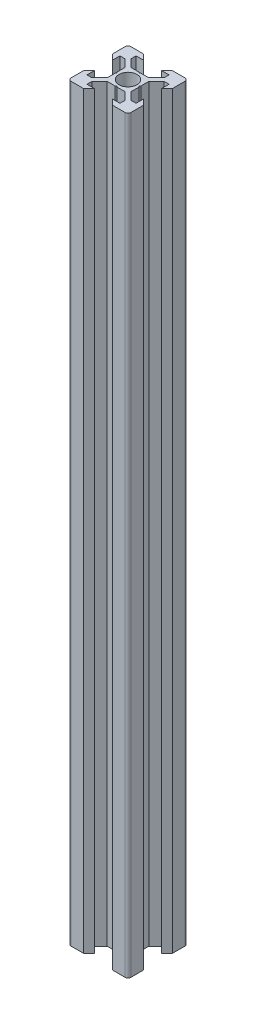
from build123d import *

# Parameters (mm, degrees)
SKETCH1_R           = 3
BOSS_EXTRUDE1_DEPTH = 250


with BuildPart() as part:
    # Sketch1 → Boss-Extrude1 (new body)
    with BuildSketch(Plane(origin=(0, 0, 0), x_dir=(1, 0, 0), z_dir=(0, 1, 0))):
        with BuildLine():
            Line((9.9996, -8.99964), (9.9996, -4.799808))
            Line((9.9996, -4.799808), (8.199672, -2.99988))
            Line((8.199672, -2.99988), (8.199672, -5.49978))
            Line((8.199672, -5.49978), (6.560397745, -5.49978))
            Line((6.560397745, -5.49978), (3.99984, -2.939222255))
            Line((3.99984, -2.939222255), (3.99984, -0.299988))
            Line((3.99984, -0.299988), (3.699852, 0))
            Line((3.699852, 0), (3.99984, 0.299988))
            Line((3.99984, 0.299988), (3.99984, 2.939222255))
            Line((3.99984, 2.939222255), (6.560397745, 5.49978))
            Line((6.560397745, 5.49978), (8.199672, 5.49978))
            Line((8.199672, 5.49978), (8.199672, 2.99988))
            Line((8.199672, 2.99988), (9.9996, 4.799808))
            Line((9.9996, 4.799808), (9.9996, 8.99964))
            ThreePointArc((9.9996, 8.99964), (9.706718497, 9.706718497), (8.99964, 9.9996))
            Line((8.99964, 9.9996), (4.799808, 9.9996))
            Line((4.799808, 9.9996), (2.99988, 8.199672))
            Line((2.99988, 8.199672), (5.49978, 8.199672))
            Line((5.49978, 8.199672), (5.49978, 6.560397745))
            Line((5.49978, 6.560397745), (2.939222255, 3.99984))
            Line((2.939222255, 3.99984), (0.299988, 3.99984))
            Line((0.299988, 3.99984), (0, 3.699852))
            Line((0, 3.699852), (-0.299988, 3.99984))
            Line((-0.299988, 3.99984), (-2.939222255, 3.99984))
            Line((-2.939222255, 3.99984), (-5.49978, 6.560397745))
            Line((-5.49978, 6.560397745), (-5.49978, 8.199672))
            Line((-5.49978, 8.199672), (-2.99988, 8.199672))
            Line((-2.99988, 8.199672), (-4.799808, 9.9996))
            Line((-4.799808, 9.9996), (-8.99964, 9.9996))
            ThreePointArc((-8.99964, 9.9996), (-9.706718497, 9.706718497), (-9.9996, 8.99964))
            Line((-9.9996, 8.99964), (-9.9996, 4.799808))
            Line((-9.9996, 4.799808), (-8.199672, 2.99988))
            Line((-8.199672, 2.99988), (-8.199672, 5.49978))
            Line((-8.199672, 5.49978), (-6.560397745, 5.49978))
            Line((-6.560397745, 5.49978), (-3.99984, 2.939222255))
            Line((-3.99984, 2.939222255), (-3.99984, 0.299988))
            Line((-3.99984, 0.299988), (-3.699852, 0))
            Line((-3.699852, 0), (-3.99984, -0.299988))
            Line((-3.99984, -0.299988), (-3.99984, -2.939222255))
            Line((-3.99984, -2.939222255), (-6.560397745, -5.49978))
            Line((-6.560397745, -5.49978), (-8.199672, -5.49978))
            Line((-8.199672, -5.49978), (-8.199672, -2.99988))
            Line((-8.199672, -2.99988), (-9.9996, -4.799808))
            Line((-9.9996, -4.799808), (-9.9996, -8.99964))
            ThreePointArc((-9.9996, -8.99964), (-9.706718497, -9.706718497), (-8.99964, -9.9996))
            Line((-8.99964, -9.9996), (-4.799808, -9.9996))
            Line((-4.799808, -9.9996), (-2.99988, -8.199672))
            Line((-2.99988, -8.199672), (-5.49978, -8.199672))
            Line((-5.49978, -8.199672), (-5.49978, -6.560397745))
            Line((-5.49978, -6.560397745), (-2.939222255, -3.99984))
            Line((-2.939222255, -3.99984), (-0.299988, -3.99984))
            Line((-0.299988, -3.99984), (0, -3.699852))
            Line((0, -3.699852), (0.299988, -3.99984))
            Line((0.299988, -3.99984), (2.939222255, -3.99984))
            Line((2.939222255, -3.99984), (5.49978, -6.560397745))
            Line((5.49978, -6.560397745), (5.49978, -8.199672))
            Line((5.49978, -8.199672), (2.99988, -8.199672))
            Line((2.99988, -8.199672), (4.799808, -9.9996))
            Line((4.799808, -9.9996), (8.99964, -9.9996))
            ThreePointArc((8.99964, -9.9996), (9.706718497, -9.706718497), (9.9996, -8.99964))
        make_face()
        with Locations(Location((0, 0, 0), (0, 0, 270))):
            Circle(SKETCH1_R, mode=Mode.SUBTRACT)
    extrude(amount=BOSS_EXTRUDE1_DEPTH)


solid = part.part
